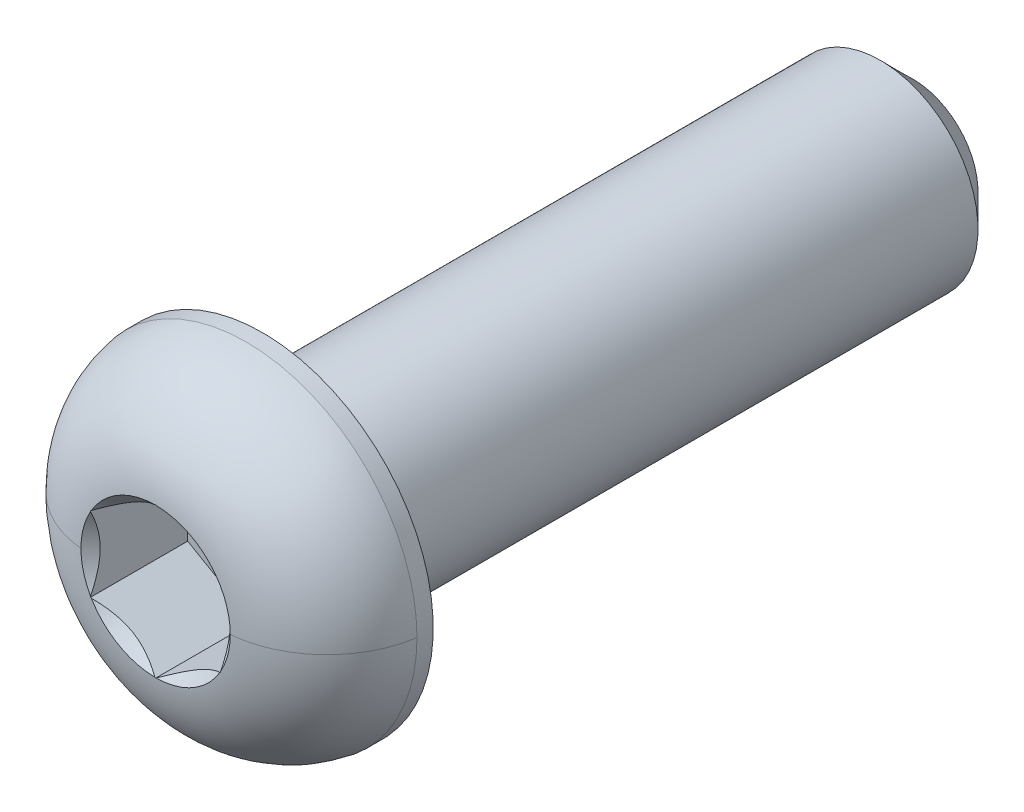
ISO-10303-21;
HEADER;
FILE_DESCRIPTION(('STEP AP214'),'2;1');
FILE_NAME('part.step','',(''),(''),'','','');
FILE_SCHEMA(('AUTOMOTIVE_DESIGN { 1 0 10303 214 1 1 1 1 }'));
ENDSEC;
DATA;
#1=APPLICATION_CONTEXT('core data for automotive mechanical design processes');
#2=APPLICATION_PROTOCOL_DEFINITION('international standard','automotive_design',2000,#1);
#3=PRODUCT_CONTEXT('',#1,'mechanical');
#4=PRODUCT('Part','Part','',(#3));
#5=PRODUCT_RELATED_PRODUCT_CATEGORY('part','',(#4));
#6=PRODUCT_DEFINITION_FORMATION('','',#4);
#7=PRODUCT_DEFINITION_CONTEXT('part definition',#1,'design');
#8=PRODUCT_DEFINITION('design','',#6,#7);
#9=PRODUCT_DEFINITION_SHAPE('','',#8);
#10=(LENGTH_UNIT() NAMED_UNIT(*) SI_UNIT(.MILLI.,.METRE.));
#11=(NAMED_UNIT(*) PLANE_ANGLE_UNIT() SI_UNIT($,.RADIAN.));
#12=(NAMED_UNIT(*) SI_UNIT($,.STERADIAN.) SOLID_ANGLE_UNIT());
#13=UNCERTAINTY_MEASURE_WITH_UNIT(LENGTH_MEASURE(1.E-05),#10,'distance_accuracy_value','');
#14=(GEOMETRIC_REPRESENTATION_CONTEXT(3) GLOBAL_UNCERTAINTY_ASSIGNED_CONTEXT((#13)) GLOBAL_UNIT_ASSIGNED_CONTEXT((#10,
#11,#12)) REPRESENTATION_CONTEXT('',''));
#15=CARTESIAN_POINT('',(0.,0.,0.));
#16=DIRECTION('',(0.,0.,1.));
#17=DIRECTION('',(1.,0.,0.));
#18=AXIS2_PLACEMENT_3D('',#15,#16,#17);
#19=CARTESIAN_POINT('',(-5.313,-5.313,0.));
#20=DIRECTION('',(0.,0.,1.));
#21=DIRECTION('',(1.,0.,0.));
#22=AXIS2_PLACEMENT_3D('',#19,#20,#21);
#23=PLANE('',#22);
#24=CARTESIAN_POINT('',(0.,0.,0.));
#25=DIRECTION('',(0.,0.,-1.));
#26=DIRECTION('',(-1.,0.,0.));
#27=AXIS2_PLACEMENT_3D('',#24,#25,#26);
#28=CIRCLE('',#27,5.25);
#29=CARTESIAN_POINT('',(-5.25,0.,0.));
#30=VERTEX_POINT('',#29);
#31=EDGE_CURVE('E167',#30,#30,#28,.T.);
#32=ORIENTED_EDGE('',*,*,#31,.T.);
#33=EDGE_LOOP('',(#32));
#34=FACE_BOUND('',#33,.T.);
#35=CARTESIAN_POINT('',(0.,0.,-3.011999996E-09));
#36=DIRECTION('',(0.,0.,-1.));
#37=DIRECTION('',(-1.,0.,0.));
#38=AXIS2_PLACEMENT_3D('',#35,#36,#37);
#39=CIRCLE('',#38,3.);
#40=CARTESIAN_POINT('',(-3.,0.,-3.011999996E-09));
#41=VERTEX_POINT('',#40);
#42=EDGE_CURVE('E158',#41,#41,#39,.T.);
#43=ORIENTED_EDGE('',*,*,#42,.F.);
#44=EDGE_LOOP('',(#43));
#45=FACE_BOUND('',#44,.T.);
#46=ADVANCED_FACE('F14',(#34,#45),#23,.F.);
#47=CARTESIAN_POINT('',(0.,0.,2.988822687));
#48=DIRECTION('',(0.,0.,1.));
#49=DIRECTION('',(1.,0.,0.));
#50=AXIS2_PLACEMENT_3D('',#47,#48,#49);
#51=CONICAL_SURFACE('',#50,1.998223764,0.785398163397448);
#52=CARTESIAN_POINT('',(0.,0.,3.28663823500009));
#53=DIRECTION('',(0.,0.,1.));
#54=DIRECTION('',(1.,0.,0.));
#55=AXIS2_PLACEMENT_3D('',#52,#53,#54);
#56=CIRCLE('',#55,2.296039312);
#57=CARTESIAN_POINT('',(-2.,1.12773956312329,3.28663823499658));
#58=VERTEX_POINT('',#57);
#59=CARTESIAN_POINT('',(-2.296039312,-6.27900713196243E-10,3.28663823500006));
#60=VERTEX_POINT('',#59);
#61=EDGE_CURVE('E160',#58,#60,#56,.T.);
#62=ORIENTED_EDGE('',*,*,#61,.T.);
#63=CARTESIAN_POINT('',(0.,0.,3.28663823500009));
#64=DIRECTION('',(0.,0.,1.));
#65=DIRECTION('',(1.,0.,0.));
#66=AXIS2_PLACEMENT_3D('',#63,#64,#65);
#67=CIRCLE('',#66,2.296039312);
#68=CARTESIAN_POINT('',(-2.,-1.12773956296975,3.28663823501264));
#69=VERTEX_POINT('',#68);
#70=EDGE_CURVE('E122',#60,#69,#67,.T.);
#71=ORIENTED_EDGE('',*,*,#70,.T.);
#72=CARTESIAN_POINT('',(-2.00000000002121,-1.12773956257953,3.28663823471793));
#73=CARTESIAN_POINT('',(-2.00000000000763,-1.04995568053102,3.24846468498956));
#74=CARTESIAN_POINT('',(-2.00000000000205,-0.970887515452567,3.21259601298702));
#75=CARTESIAN_POINT('',(-1.99999999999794,-0.809751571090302,3.14703477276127));
#76=CARTESIAN_POINT('',(-1.99999999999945,-0.727669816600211,3.11737685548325));
#77=CARTESIAN_POINT('',(-2.00000000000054,-0.562175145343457,3.0666412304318));
#78=CARTESIAN_POINT('',(-2.00000000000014,-0.478800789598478,3.04544123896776));
#79=CARTESIAN_POINT('',(-1.99999999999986,-0.310294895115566,3.0128477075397));
#80=CARTESIAN_POINT('',(-1.99999999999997,-0.225167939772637,3.00143126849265));
#81=CARTESIAN_POINT('',(-2.00000000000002,-0.0771243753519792,2.99110892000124));
#82=CARTESIAN_POINT('',(-2.00000000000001,-0.0143780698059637,2.98966784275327));
#83=CARTESIAN_POINT('',(-1.99999999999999,0.110995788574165,2.99269670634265));
#84=CARTESIAN_POINT('',(-2.,0.17362329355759,2.99716866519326));
#85=CARTESIAN_POINT('',(-2.,0.298253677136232,3.01176649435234));
#86=CARTESIAN_POINT('',(-2.,0.360256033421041,3.02189674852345));
#87=CARTESIAN_POINT('',(-2.,0.483213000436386,3.04726391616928));
#88=CARTESIAN_POINT('',(-2.,0.544167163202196,3.06250295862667));
#89=CARTESIAN_POINT('',(-2.,0.694818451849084,3.10608759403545));
#90=CARTESIAN_POINT('',(-2.,0.783722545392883,3.13718154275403));
#91=CARTESIAN_POINT('',(-2.,0.914589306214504,3.18943430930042));
#92=CARTESIAN_POINT('',(-2.,0.957734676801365,3.20775597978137));
#93=CARTESIAN_POINT('',(-2.,1.04327976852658,3.24603158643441));
#94=CARTESIAN_POINT('',(-2.,1.08567973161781,3.26598498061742));
#95=CARTESIAN_POINT('',(-2.,1.12773956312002,3.28663823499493));
#96=B_SPLINE_CURVE_WITH_KNOTS('',3,(#72,#73,#74,#75,#76,#77,#78,#79,#80,#81,#82,#83,#84,#85,#86,
#87,#88,#89,#90,#91,#92,#93,#94,#95),.UNSPECIFIED.,.F.,.F.,(4,2,2,2,2,2,2,2,2,2,2,4),(0.,
0.260109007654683,0.521632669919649,0.779224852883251,1.03621246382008,1.22423404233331,
1.41231980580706,1.60055149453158,1.78886172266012,2.07089239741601,2.2114924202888,
2.35204593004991),.UNSPECIFIED.);
#97=EDGE_CURVE('E297',#69,#58,#96,.T.);
#98=ORIENTED_EDGE('',*,*,#97,.T.);
#99=EDGE_LOOP('',(#62,#71,#98));
#100=FACE_BOUND('',#99,.T.);
#101=ADVANCED_FACE('F265',(#100),#51,.F.);
#102=CARTESIAN_POINT('',(2.,-1.154700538,3.304558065));
#103=DIRECTION('',(0.500000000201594,-0.866025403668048,0.));
#104=DIRECTION('',(-0.866025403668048,-0.500000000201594,0.));
#105=AXIS2_PLACEMENT_3D('',#102,#103,#104);
#106=PLANE('',#105);
#107=DIRECTION('',(0.,0.,-1.));
#108=VECTOR('',#107,1.);
#109=CARTESIAN_POINT('',(2.,-1.154700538,1.8022790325));
#110=LINE('',#109,#108);
#111=CARTESIAN_POINT('',(2.00000000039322,-1.15470053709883,3.28540209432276));
#112=VERTEX_POINT('',#111);
#113=CARTESIAN_POINT('',(2.,-1.15470053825,0.3));
#114=VERTEX_POINT('',#113);
#115=EDGE_CURVE('E147',#112,#114,#110,.T.);
#116=ORIENTED_EDGE('',*,*,#115,.T.);
#117=DIRECTION('',(0.866025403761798,0.500000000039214,0.));
#118=VECTOR('',#117,1.);
#119=CARTESIAN_POINT('',(0.,-2.309401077,0.3));
#120=LINE('',#119,#118);
#121=CARTESIAN_POINT('',(0.,-2.309401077,0.3));
#122=VERTEX_POINT('',#121);
#123=EDGE_CURVE('E326',#122,#114,#120,.T.);
#124=ORIENTED_EDGE('',*,*,#123,.F.);
#125=DIRECTION('',(0.,0.,1.));
#126=VECTOR('',#125,1.);
#127=CARTESIAN_POINT('',(0.,-2.309401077,1.802279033));
#128=LINE('',#127,#126);
#129=CARTESIAN_POINT('',(5.87739642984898E-11,-2.30940107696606,3.28540209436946));
#130=VERTEX_POINT('',#129);
#131=EDGE_CURVE('E118',#122,#130,#128,.T.);
#132=ORIENTED_EDGE('',*,*,#131,.T.);
#133=CARTESIAN_POINT('',(0.0233488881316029,-2.2959205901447,3.28663823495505));
#134=CARTESIAN_POINT('',(0.015565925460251,-2.30041408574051,3.28622618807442));
#135=CARTESIAN_POINT('',(0.00778296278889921,-2.30490758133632,3.28581414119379));
#136=CARTESIAN_POINT('',(1.17547386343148E-10,-2.30940107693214,3.28540209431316));
#137=B_SPLINE_CURVE_WITH_KNOTS('',3,(#133,#134,#135,#136),.UNSPECIFIED.,.F.,.F.,(4,4),(0.,
0.0269892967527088),.UNSPECIFIED.);
#138=CARTESIAN_POINT('',(0.0233488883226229,-2.29592059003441,3.28663823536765));
#139=VERTEX_POINT('',#138);
#140=EDGE_CURVE('E111',#139,#130,#137,.T.);
#141=ORIENTED_EDGE('',*,*,#140,.F.);
#142=CARTESIAN_POINT('',(1.97665111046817,-1.16818102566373,3.28663823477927));
#143=CARTESIAN_POINT('',(1.90928829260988,-1.20707296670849,3.24846468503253));
#144=CARTESIAN_POINT('',(1.84081325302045,-1.24660704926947,3.21259601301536));
#145=CARTESIAN_POINT('',(1.7012654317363,-1.32717502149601,3.14703477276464));
#146=CARTESIAN_POINT('',(1.63018054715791,-1.36821589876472,3.11737685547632));
#147=CARTESIAN_POINT('',(1.4868579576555,-1.45096323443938,3.06664123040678));
#148=CARTESIAN_POINT('',(1.41465364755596,-1.49265041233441,3.04544123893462));
#149=CARTESIAN_POINT('',(1.26872326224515,-1.57690335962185,3.01284770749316));
#150=CARTESIAN_POINT('',(1.19500115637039,-1.61946683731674,3.00143126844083));
#151=CARTESIAN_POINT('',(1.06679166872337,-1.69348861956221,2.99110891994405));
#152=CARTESIAN_POINT('',(1.01245177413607,-1.72486177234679,2.98966784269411));
#153=CARTESIAN_POINT('',(0.903874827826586,-1.78754870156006,2.99269670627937));
#154=CARTESIAN_POINT('',(0.84963781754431,-1.8188624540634,2.99716866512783));
#155=CARTESIAN_POINT('',(0.741704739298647,-1.8811776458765,3.01176649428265));
#156=CARTESIAN_POINT('',(0.688009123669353,-1.91217882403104,3.02189674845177));
#157=CARTESIAN_POINT('',(0.581525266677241,-1.97365730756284,3.04726391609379));
#158=CARTESIAN_POINT('',(0.528737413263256,-2.00413438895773,3.06250295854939));
#159=CARTESIAN_POINT('',(0.39826956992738,-2.07946003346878,3.10608759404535));
#160=CARTESIAN_POINT('',(0.321276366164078,-2.12391208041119,3.13718154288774));
#161=CARTESIAN_POINT('',(0.207942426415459,-2.18934546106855,3.18943430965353));
#162=CARTESIAN_POINT('',(0.170577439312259,-2.21091814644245,3.20775598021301));
#163=CARTESIAN_POINT('',(0.0964932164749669,-2.25369069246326,3.24603158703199));
#164=CARTESIAN_POINT('',(0.0597737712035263,-2.27489067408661,3.26598498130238));
#165=CARTESIAN_POINT('',(0.0233488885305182,-2.29592058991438,3.28663823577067));
#166=B_SPLINE_CURVE_WITH_KNOTS('',3,(#142,#143,#144,#145,#146,#147,#148,#149,#150,#151,#152,
#153,#154,#155,#156,#157,#158,#159,#160,#161,#162,#163,#164,#165),.UNSPECIFIED.,.F.,.F.,(4,2,2,
2,2,2,2,2,2,2,2,4),(0.,0.260109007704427,0.521632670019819,0.779224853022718,1.03621246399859,
1.2242340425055,1.41231980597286,1.60055149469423,1.78886172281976,2.07089239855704,
2.21149242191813,2.35204593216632),.UNSPECIFIED.);
#167=CARTESIAN_POINT('',(1.97665111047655,-1.16818102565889,3.28663823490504));
#168=VERTEX_POINT('',#167);
#169=EDGE_CURVE('E115',#168,#139,#166,.T.);
#170=ORIENTED_EDGE('',*,*,#169,.F.);
#171=CARTESIAN_POINT('',(2.00000000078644,-1.15470053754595,3.28540209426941));
#172=CARTESIAN_POINT('',(1.99221703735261,-1.15919403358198,3.28581414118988));
#173=CARTESIAN_POINT('',(1.98443407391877,-1.16368752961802,3.28622618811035));
#174=CARTESIAN_POINT('',(1.97665111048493,-1.16818102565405,3.28663823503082));
#175=B_SPLINE_CURVE_WITH_KNOTS('',3,(#171,#172,#173,#174),.UNSPECIFIED.,.F.,.F.,(4,4),(0.,
0.0269892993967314),.UNSPECIFIED.);
#176=EDGE_CURVE('E121',#112,#168,#175,.T.);
#177=ORIENTED_EDGE('',*,*,#176,.F.);
#178=EDGE_LOOP('',(#116,#124,#132,#141,#170,#177));
#179=FACE_BOUND('',#178,.T.);
#180=ADVANCED_FACE('F113',(#179),#106,.F.);
#181=CARTESIAN_POINT('',(0.,-2.309401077,3.304558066));
#182=DIRECTION('',(-0.500000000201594,-0.866025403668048,0.));
#183=DIRECTION('',(-0.866025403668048,0.500000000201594,0.));
#184=AXIS2_PLACEMENT_3D('',#181,#182,#183);
#185=PLANE('',#184);
#186=ORIENTED_EDGE('',*,*,#131,.F.);
#187=DIRECTION('',(0.866025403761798,-0.500000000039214,0.));
#188=VECTOR('',#187,1.);
#189=CARTESIAN_POINT('',(-2.,-1.1547005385,0.3));
#190=LINE('',#189,#188);
#191=CARTESIAN_POINT('',(-2.,-1.15470053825,0.3));
#192=VERTEX_POINT('',#191);
#193=EDGE_CURVE('E329',#192,#122,#190,.T.);
#194=ORIENTED_EDGE('',*,*,#193,.F.);
#195=DIRECTION('',(0.,0.,1.));
#196=VECTOR('',#195,1.);
#197=CARTESIAN_POINT('',(-2.,-1.154700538,1.802279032));
#198=LINE('',#197,#196);
#199=CARTESIAN_POINT('',(-2.00000000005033,-1.15470053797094,3.28540209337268));
#200=VERTEX_POINT('',#199);
#201=EDGE_CURVE('E142',#192,#200,#198,.T.);
#202=ORIENTED_EDGE('',*,*,#201,.T.);
#203=CARTESIAN_POINT('',(-1.97665111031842,-1.16818102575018,3.28663823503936));
#204=CARTESIAN_POINT('',(-1.98443407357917,-1.16368752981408,3.28622618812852));
#205=CARTESIAN_POINT('',(-1.99221703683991,-1.15919403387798,3.28581414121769));
#206=CARTESIAN_POINT('',(-2.00000000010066,-1.15470053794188,3.28540209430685));
#207=B_SPLINE_CURVE_WITH_KNOTS('',3,(#203,#204,#205,#206),.UNSPECIFIED.,.F.,.F.,(4,4),(0.,
0.0269892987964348),.UNSPECIFIED.);
#208=CARTESIAN_POINT('',(-1.9766511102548,-1.16818102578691,3.28663823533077));
#209=VERTEX_POINT('',#208);
#210=EDGE_CURVE('E153',#209,#200,#207,.T.);
#211=ORIENTED_EDGE('',*,*,#210,.F.);
#212=CARTESIAN_POINT('',(-0.0233488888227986,-2.29592058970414,3.28663823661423));
#213=CARTESIAN_POINT('',(-0.0907117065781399,-2.25702864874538,3.2484646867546));
#214=CARTESIAN_POINT('',(-0.159186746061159,-2.21749456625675,3.21259601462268));
#215=CARTESIAN_POINT('',(-0.29873456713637,-2.13692659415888,3.14703477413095));
#216=CARTESIAN_POINT('',(-0.369819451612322,-2.09588571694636,3.11737685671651));
#217=CARTESIAN_POINT('',(-0.513142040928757,-2.01313838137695,3.06664123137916));
#218=CARTESIAN_POINT('',(-0.585346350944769,-1.97145120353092,3.04544123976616));
#219=CARTESIAN_POINT('',(-0.731276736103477,-1.88719825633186,3.01284770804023));
#220=CARTESIAN_POINT('',(-0.804998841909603,-1.84463477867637,3.00143126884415));
#221=CARTESIAN_POINT('',(-0.93320832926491,-1.77061299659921,2.9911089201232));
#222=CARTESIAN_POINT('',(-0.987548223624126,-1.73923984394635,2.98966784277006));
#223=CARTESIAN_POINT('',(-1.09612516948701,-1.67655291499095,2.99269670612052));
#224=CARTESIAN_POINT('',(-1.15036217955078,-1.64523916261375,2.99716866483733));
#225=CARTESIAN_POINT('',(-1.25829525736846,-1.58292397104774,3.01176649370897));
#226=CARTESIAN_POINT('',(-1.31199087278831,-1.55192279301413,3.02189674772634));
#227=CARTESIAN_POINT('',(-1.4184747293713,-1.49044430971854,3.04726391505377));
#228=CARTESIAN_POINT('',(-1.4712625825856,-1.45996722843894,3.06250295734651));
#229=CARTESIAN_POINT('',(-1.60173042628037,-1.38464158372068,3.10608759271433));
#230=CARTESIAN_POINT('',(-1.67872363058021,-1.34018953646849,3.13718154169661));
#231=CARTESIAN_POINT('',(-1.79205757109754,-1.27475615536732,3.18943430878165));
#232=CARTESIAN_POINT('',(-1.82942255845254,-1.25318346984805,3.20775597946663));
#233=CARTESIAN_POINT('',(-1.90350678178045,-1.21041092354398,3.24603158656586));
#234=CARTESIAN_POINT('',(-1.94022622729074,-1.18921094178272,3.26598498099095));
#235=CARTESIAN_POINT('',(-1.97665111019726,-1.16818102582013,3.28663823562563));
#236=B_SPLINE_CURVE_WITH_KNOTS('',3,(#212,#213,#214,#215,#216,#217,#218,#219,#220,#221,#222,
#223,#224,#225,#226,#227,#228,#229,#230,#231,#232,#233,#234,#235),.UNSPECIFIED.,.F.,.F.,(4,2,2,
2,2,2,2,2,2,2,2,4),(0.,0.260109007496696,0.521632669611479,0.779224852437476,1.03621246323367,
1.22423404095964,1.41231980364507,1.60055149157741,1.78886171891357,2.07089239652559,
2.21149242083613,2.35204593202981),.UNSPECIFIED.);
#237=CARTESIAN_POINT('',(-0.023348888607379,-2.29592058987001,3.28663823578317));
#238=VERTEX_POINT('',#237);
#239=EDGE_CURVE('E127',#238,#209,#236,.T.);
#240=ORIENTED_EDGE('',*,*,#239,.F.);
#241=CARTESIAN_POINT('',(-1.1754803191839E-10,-2.30940107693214,3.28540209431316));
#242=CARTESIAN_POINT('',(-0.00778296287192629,-2.30490758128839,3.28581414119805));
#243=CARTESIAN_POINT('',(-0.0155659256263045,-2.30041408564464,3.28622618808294));
#244=CARTESIAN_POINT('',(-0.0233488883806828,-2.29592059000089,3.28663823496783));
#245=B_SPLINE_CURVE_WITH_KNOTS('',3,(#241,#242,#243,#244),.UNSPECIFIED.,.F.,.F.,(4,4),(0.,
0.0269892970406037),.UNSPECIFIED.);
#246=EDGE_CURVE('E152',#130,#238,#245,.T.);
#247=ORIENTED_EDGE('',*,*,#246,.F.);
#248=EDGE_LOOP('',(#186,#194,#202,#211,#240,#247));
#249=FACE_BOUND('',#248,.T.);
#250=ADVANCED_FACE('F264',(#249),#185,.F.);
#251=CARTESIAN_POINT('',(-2.,-1.154700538,0.3));
#252=DIRECTION('',(-1.,0.,0.));
#253=DIRECTION('',(0.,0.,1.));
#254=AXIS2_PLACEMENT_3D('',#251,#252,#253);
#255=PLANE('',#254);
#256=ORIENTED_EDGE('',*,*,#201,.F.);
#257=DIRECTION('',(0.,-1.,0.));
#258=VECTOR('',#257,1.);
#259=CARTESIAN_POINT('',(-2.,0.,0.3));
#260=LINE('',#259,#258);
#261=CARTESIAN_POINT('',(-2.,1.15470053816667,0.3));
#262=VERTEX_POINT('',#261);
#263=EDGE_CURVE('E331',#262,#192,#260,.T.);
#264=ORIENTED_EDGE('',*,*,#263,.F.);
#265=DIRECTION('',(0.,0.,1.));
#266=VECTOR('',#265,1.);
#267=CARTESIAN_POINT('',(-2.,1.154700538,1.802279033));
#268=LINE('',#267,#266);
#269=CARTESIAN_POINT('',(-2.,1.15470053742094,3.28540209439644));
#270=VERTEX_POINT('',#269);
#271=EDGE_CURVE('E344',#262,#270,#268,.T.);
#272=ORIENTED_EDGE('',*,*,#271,.T.);
#273=CARTESIAN_POINT('',(-2.,1.1277395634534,3.28663823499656));
#274=CARTESIAN_POINT('',(-2.,1.1367265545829,3.28622618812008));
#275=CARTESIAN_POINT('',(-2.,1.14571354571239,3.28581414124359));
#276=CARTESIAN_POINT('',(-2.,1.15470053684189,3.28540209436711));
#277=B_SPLINE_CURVE_WITH_KNOTS('',3,(#273,#274,#275,#276),.UNSPECIFIED.,.F.,.F.,(4,4),(0.,
0.0269892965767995),.UNSPECIFIED.);
#278=EDGE_CURVE('E146',#58,#270,#277,.T.);
#279=ORIENTED_EDGE('',*,*,#278,.F.);
#280=ORIENTED_EDGE('',*,*,#97,.F.);
#281=CARTESIAN_POINT('',(-2.,-1.15470053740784,3.28540209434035));
#282=CARTESIAN_POINT('',(-2.,-1.14571354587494,3.28581414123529));
#283=CARTESIAN_POINT('',(-2.,-1.13672655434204,3.28622618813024));
#284=CARTESIAN_POINT('',(-2.,-1.12773956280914,3.28663823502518));
#285=B_SPLINE_CURVE_WITH_KNOTS('',3,(#281,#282,#283,#284),.UNSPECIFIED.,.F.,.F.,(4,4),(0.,
0.0269892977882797),.UNSPECIFIED.);
#286=EDGE_CURVE('E145',#200,#69,#285,.T.);
#287=ORIENTED_EDGE('',*,*,#286,.F.);
#288=EDGE_LOOP('',(#256,#264,#272,#279,#280,#287));
#289=FACE_BOUND('',#288,.T.);
#290=ADVANCED_FACE('F307',(#289),#255,.F.);
#291=CARTESIAN_POINT('',(2.,1.154700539,3.304558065));
#292=DIRECTION('',(1.,0.,0.));
#293=DIRECTION('',(0.,-1.,0.));
#294=AXIS2_PLACEMENT_3D('',#291,#292,#293);
#295=PLANE('',#294);
#296=DIRECTION('',(0.,0.,-1.));
#297=VECTOR('',#296,1.);
#298=CARTESIAN_POINT('',(2.,1.154700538,1.8022790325));
#299=LINE('',#298,#297);
#300=CARTESIAN_POINT('',(2.00000000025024,1.15470053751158,3.28540209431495));
#301=VERTEX_POINT('',#300);
#302=CARTESIAN_POINT('',(2.,1.154700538,0.3));
#303=VERTEX_POINT('',#302);
#304=EDGE_CURVE('E351',#301,#303,#299,.T.);
#305=ORIENTED_EDGE('',*,*,#304,.T.);
#306=DIRECTION('',(0.,1.,0.));
#307=VECTOR('',#306,1.);
#308=CARTESIAN_POINT('',(2.,0.,0.3));
#309=LINE('',#308,#307);
#310=EDGE_CURVE('E328',#114,#303,#309,.T.);
#311=ORIENTED_EDGE('',*,*,#310,.F.);
#312=ORIENTED_EDGE('',*,*,#115,.F.);
#313=CARTESIAN_POINT('',(2.,-1.12773956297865,3.28663823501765));
#314=CARTESIAN_POINT('',(2.,-1.136726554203,3.28622618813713));
#315=CARTESIAN_POINT('',(2.,-1.14571354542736,3.28581414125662));
#316=CARTESIAN_POINT('',(2.,-1.15470053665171,3.2854020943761));
#317=B_SPLINE_CURVE_WITH_KNOTS('',3,(#313,#314,#315,#316),.UNSPECIFIED.,.F.,.F.,(4,4),(0.,
0.0269892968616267),.UNSPECIFIED.);
#318=CARTESIAN_POINT('',(2.,-1.12773956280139,3.28663823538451));
#319=VERTEX_POINT('',#318);
#320=EDGE_CURVE('E150',#319,#112,#317,.T.);
#321=ORIENTED_EDGE('',*,*,#320,.F.);
#322=CARTESIAN_POINT('',(2.00000000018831,1.12773956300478,3.28663823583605));
#323=CARTESIAN_POINT('',(2.00000000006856,1.05041737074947,3.24869036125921));
#324=CARTESIAN_POINT('',(2.0000000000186,0.97182557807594,3.21302111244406));
#325=CARTESIAN_POINT('',(1.99999999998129,0.81162789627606,3.14775499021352));
#326=CARTESIAN_POINT('',(1.99999999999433,0.730006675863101,3.11819607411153));
#327=CARTESIAN_POINT('',(2.00000000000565,0.564523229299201,3.06726240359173));
#328=CARTESIAN_POINT('',(2.00000000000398,0.4806706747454,3.04585703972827));
#329=CARTESIAN_POINT('',(1.99999999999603,0.311208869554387,3.01297161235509));
#330=CARTESIAN_POINT('',(1.99999999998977,0.225605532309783,3.00146244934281));
#331=CARTESIAN_POINT('',(2.00000000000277,0.116425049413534,2.99384898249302));
#332=CARTESIAN_POINT('',(2.00000000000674,0.0931516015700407,2.99263158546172));
#333=CARTESIAN_POINT('',(1.99999999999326,0.0465865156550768,2.99100636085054));
#334=CARTESIAN_POINT('',(1.99999999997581,0.0232948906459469,2.99059816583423));
#335=CARTESIAN_POINT('',(1.99999999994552,-0.0607004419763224,2.99060089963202));
#336=CARTESIAN_POINT('',(1.99999999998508,-0.121423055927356,2.99337962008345));
#337=CARTESIAN_POINT('',(2.00000000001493,-0.24239446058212,3.00432954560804));
#338=CARTESIAN_POINT('',(2.00000000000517,-0.302642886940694,3.012504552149));
#339=CARTESIAN_POINT('',(1.99999999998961,-0.482559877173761,3.04460765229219));
#340=CARTESIAN_POINT('',(1.99999999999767,-0.600919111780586,3.076108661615));
#341=CARTESIAN_POINT('',(2.00000000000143,-0.787312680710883,3.13893843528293));
#342=CARTESIAN_POINT('',(2.00000000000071,-0.857050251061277,3.16558908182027));
#343=CARTESIAN_POINT('',(1.9999999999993,-0.994046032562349,3.22316548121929));
#344=CARTESIAN_POINT('',(1.9999999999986,-1.06132038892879,3.25405256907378));
#345=CARTESIAN_POINT('',(2.,-1.12773956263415,3.28663823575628));
#346=B_SPLINE_CURVE_WITH_KNOTS('',3,(#322,#323,#324,#325,#326,#327,#328,#329,#330,#331,#332,
#333,#334,#335,#336,#337,#338,#339,#340,#341,#342,#343,#344,#345),.UNSPECIFIED.,.F.,.F.,(4,2,2,
2,2,2,2,2,2,2,2,4),(0.,0.258566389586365,0.518693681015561,0.77783456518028,1.0362108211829,
1.1061169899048,1.17599140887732,1.35806602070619,1.54026903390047,1.90609911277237,
2.12994702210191,2.3518732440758),.UNSPECIFIED.);
#347=CARTESIAN_POINT('',(2.,1.12773956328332,3.28663823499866));
#348=VERTEX_POINT('',#347);
#349=EDGE_CURVE('E128',#348,#319,#346,.T.);
#350=ORIENTED_EDGE('',*,*,#349,.F.);
#351=CARTESIAN_POINT('',(2.,1.15470053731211,3.28540209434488));
#352=CARTESIAN_POINT('',(2.,1.14571354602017,3.28581414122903));
#353=CARTESIAN_POINT('',(2.,1.13672655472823,3.28622618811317));
#354=CARTESIAN_POINT('',(2.,1.12773956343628,3.28663823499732));
#355=B_SPLINE_CURVE_WITH_KNOTS('',3,(#351,#352,#353,#354),.UNSPECIFIED.,.F.,.F.,(4,4),(0.,
0.0269892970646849),.UNSPECIFIED.);
#356=EDGE_CURVE('E149',#301,#348,#355,.T.);
#357=ORIENTED_EDGE('',*,*,#356,.F.);
#358=EDGE_LOOP('',(#305,#311,#312,#321,#350,#357));
#359=FACE_BOUND('',#358,.T.);
#360=ADVANCED_FACE('F310',(#359),#295,.F.);
#361=CARTESIAN_POINT('',(-2.,-2.309401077,0.3));
#362=DIRECTION('',(0.,0.,1.));
#363=DIRECTION('',(1.,0.,0.));
#364=AXIS2_PLACEMENT_3D('',#361,#362,#363);
#365=PLANE('',#364);
#366=ORIENTED_EDGE('',*,*,#263,.T.);
#367=ORIENTED_EDGE('',*,*,#193,.T.);
#368=ORIENTED_EDGE('',*,*,#123,.T.);
#369=ORIENTED_EDGE('',*,*,#310,.T.);
#370=DIRECTION('',(-0.866025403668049,0.500000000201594,0.));
#371=VECTOR('',#370,1.);
#372=CARTESIAN_POINT('',(1.,1.7320508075,0.3));
#373=LINE('',#372,#371);
#374=CARTESIAN_POINT('',(0.,2.309401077,0.3));
#375=VERTEX_POINT('',#374);
#376=EDGE_CURVE('E353',#303,#375,#373,.T.);
#377=ORIENTED_EDGE('',*,*,#376,.T.);
#378=DIRECTION('',(-0.866025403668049,-0.500000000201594,0.));
#379=VECTOR('',#378,1.);
#380=CARTESIAN_POINT('',(-1.,1.7320508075,0.3));
#381=LINE('',#380,#379);
#382=EDGE_CURVE('E348',#375,#262,#381,.T.);
#383=ORIENTED_EDGE('',*,*,#382,.T.);
#384=EDGE_LOOP('',(#366,#367,#368,#369,#377,#383));
#385=FACE_BOUND('',#384,.T.);
#386=ADVANCED_FACE('F292',(#385),#365,.T.);
#387=CARTESIAN_POINT('',(0.,0.,2.98868375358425));
#388=DIRECTION('',(0.,0.,1.));
#389=DIRECTION('',(0.,-1.,0.));
#390=AXIS2_PLACEMENT_3D('',#387,#388,#389);
#391=CONICAL_SURFACE('',#390,1.99808483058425,0.785398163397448);
#392=ORIENTED_EDGE('',*,*,#169,.T.);
#393=CARTESIAN_POINT('',(0.,0.,3.286638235));
#394=DIRECTION('',(0.,0.,-1.));
#395=DIRECTION('',(-1.,0.,0.));
#396=AXIS2_PLACEMENT_3D('',#393,#394,#395);
#397=CIRCLE('',#396,2.296039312);
#398=EDGE_CURVE('E126',#168,#139,#397,.T.);
#399=ORIENTED_EDGE('',*,*,#398,.F.);
#400=EDGE_LOOP('',(#392,#399));
#401=FACE_BOUND('',#400,.T.);
#402=ADVANCED_FACE('F125',(#401),#391,.F.);
#403=CARTESIAN_POINT('',(0.,0.,2.98868375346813));
#404=DIRECTION('',(0.,0.,1.));
#405=DIRECTION('',(0.,-1.,0.));
#406=AXIS2_PLACEMENT_3D('',#403,#404,#405);
#407=CONICAL_SURFACE('',#406,1.99808483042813,0.785398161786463);
#408=ORIENTED_EDGE('',*,*,#239,.T.);
#409=CARTESIAN_POINT('',(0.,0.,3.286638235));
#410=DIRECTION('',(0.,0.,-1.));
#411=DIRECTION('',(-1.,0.,0.));
#412=AXIS2_PLACEMENT_3D('',#409,#410,#411);
#413=CIRCLE('',#412,2.296039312);
#414=EDGE_CURVE('E132',#238,#209,#413,.T.);
#415=ORIENTED_EDGE('',*,*,#414,.F.);
#416=EDGE_LOOP('',(#408,#415));
#417=FACE_BOUND('',#416,.T.);
#418=ADVANCED_FACE('F291',(#417),#407,.F.);
#419=CARTESIAN_POINT('',(-2.,1.154700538,3.304558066));
#420=DIRECTION('',(-0.500000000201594,0.866025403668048,0.));
#421=DIRECTION('',(0.866025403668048,0.500000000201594,0.));
#422=AXIS2_PLACEMENT_3D('',#419,#420,#421);
#423=PLANE('',#422);
#424=ORIENTED_EDGE('',*,*,#271,.F.);
#425=ORIENTED_EDGE('',*,*,#382,.F.);
#426=DIRECTION('',(0.,0.,1.));
#427=VECTOR('',#426,1.);
#428=CARTESIAN_POINT('',(0.,2.309401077,1.8022790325));
#429=LINE('',#428,#427);
#430=CARTESIAN_POINT('',(-5.47140685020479E-11,2.30940107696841,3.28540209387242));
#431=VERTEX_POINT('',#430);
#432=EDGE_CURVE('E360',#375,#431,#429,.T.);
#433=ORIENTED_EDGE('',*,*,#432,.T.);
#434=CARTESIAN_POINT('',(-0.0233488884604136,2.29592058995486,3.28663823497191));
#435=CARTESIAN_POINT('',(-0.0155659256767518,2.30041408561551,3.28622618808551));
#436=CARTESIAN_POINT('',(-0.00778296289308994,2.30490758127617,3.28581414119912));
#437=CARTESIAN_POINT('',(-1.09428082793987E-10,2.30940107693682,3.28540209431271));
#438=B_SPLINE_CURVE_WITH_KNOTS('',3,(#434,#435,#436,#437),.UNSPECIFIED.,.F.,.F.,(4,4),(0.,
0.0269892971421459),.UNSPECIFIED.);
#439=CARTESIAN_POINT('',(-0.0233488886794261,2.29592058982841,3.28663823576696));
#440=VERTEX_POINT('',#439);
#441=EDGE_CURVE('E364',#440,#431,#438,.T.);
#442=ORIENTED_EDGE('',*,*,#441,.F.);
#443=CARTESIAN_POINT('',(-1.97665111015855,1.16818102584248,3.28663823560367));
#444=CARTESIAN_POINT('',(-1.90928829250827,1.20707296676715,3.24846468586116));
#445=CARTESIAN_POINT('',(-1.84081325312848,1.2466070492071,3.21259601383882));
#446=CARTESIAN_POINT('',(-1.70126543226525,1.32717502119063,3.14703477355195));
#447=CARTESIAN_POINT('',(-1.63018054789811,1.36821589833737,3.11737685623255));
#448=CARTESIAN_POINT('',(-1.4868579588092,1.45096323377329,3.06664123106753));
#449=CARTESIAN_POINT('',(-1.41465364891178,1.49265041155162,3.04544123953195));
#450=CARTESIAN_POINT('',(-1.26872326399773,1.57690335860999,3.01284770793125));
#451=CARTESIAN_POINT('',(-1.19500115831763,1.61946683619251,3.00143126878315));
#452=CARTESIAN_POINT('',(-1.06679167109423,1.69348861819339,2.99110892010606));
#453=CARTESIAN_POINT('',(-1.01245177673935,1.72486177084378,2.98966784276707));
#454=CARTESIAN_POINT('',(-0.903874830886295,1.78754869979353,2.99269670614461));
#455=CARTESIAN_POINT('',(-0.849637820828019,1.81886245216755,2.99716866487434));
#456=CARTESIAN_POINT('',(-0.741704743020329,1.88117764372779,3.01176649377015));
#457=CARTESIAN_POINT('',(-0.688009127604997,1.9121788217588,3.02189674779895));
#458=CARTESIAN_POINT('',(-0.581525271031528,1.97365730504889,3.0472639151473));
#459=CARTESIAN_POINT('',(-0.528737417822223,2.00413438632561,3.06250295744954));
#460=CARTESIAN_POINT('',(-0.398269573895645,2.0794600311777,3.10608759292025));
#461=CARTESIAN_POINT('',(-0.321276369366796,2.1239120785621,3.1371815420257));
#462=CARTESIAN_POINT('',(-0.207942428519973,2.18934545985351,3.18943430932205));
#463=CARTESIAN_POINT('',(-0.170577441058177,2.21091814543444,3.20775598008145));
#464=CARTESIAN_POINT('',(-0.0964932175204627,2.25369069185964,3.24603158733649));
#465=CARTESIAN_POINT('',(-0.059773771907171,2.27489067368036,3.26598498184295));
#466=CARTESIAN_POINT('',(-0.0233488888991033,2.29592058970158,3.28663823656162));
#467=B_SPLINE_CURVE_WITH_KNOTS('',3,(#443,#444,#445,#446,#447,#448,#449,#450,#451,#452,#453,
#454,#455,#456,#457,#458,#459,#460,#461,#462,#463,#464,#465,#466),.UNSPECIFIED.,.F.,.F.,(4,2,2,
2,2,2,2,2,2,2,2,4),(0.,0.260109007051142,0.521632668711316,0.779224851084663,1.03621246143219,
1.22423403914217,1.41231980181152,1.60055148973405,1.78886171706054,2.07089239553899,
2.21149242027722,2.35204593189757),.UNSPECIFIED.);
#468=CARTESIAN_POINT('',(-1.9766511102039,1.1681810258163,3.28663823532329));
#469=VERTEX_POINT('',#468);
#470=EDGE_CURVE('E136',#469,#440,#467,.T.);
#471=ORIENTED_EDGE('',*,*,#470,.F.);
#472=CARTESIAN_POINT('',(-2.00000000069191,1.15470053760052,3.28540209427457));
#473=CARTESIAN_POINT('',(-1.99221703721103,1.15919403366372,3.28581414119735));
#474=CARTESIAN_POINT('',(-1.98443407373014,1.16368752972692,3.28622618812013));
#475=CARTESIAN_POINT('',(-1.97665111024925,1.16818102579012,3.28663823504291));
#476=B_SPLINE_CURVE_WITH_KNOTS('',3,(#472,#473,#474,#475),.UNSPECIFIED.,.F.,.F.,(4,4),(0.,
0.0269892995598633),.UNSPECIFIED.);
#477=EDGE_CURVE('E347',#270,#469,#476,.T.);
#478=ORIENTED_EDGE('',*,*,#477,.F.);
#479=EDGE_LOOP('',(#424,#425,#433,#442,#471,#478));
#480=FACE_BOUND('',#479,.T.);
#481=ADVANCED_FACE('F426',(#480),#423,.F.);
#482=CARTESIAN_POINT('',(0.,2.309401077,3.304558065));
#483=DIRECTION('',(0.500000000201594,0.866025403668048,0.));
#484=DIRECTION('',(0.866025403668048,-0.500000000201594,0.));
#485=AXIS2_PLACEMENT_3D('',#482,#483,#484);
#486=PLANE('',#485);
#487=ORIENTED_EDGE('',*,*,#432,.F.);
#488=ORIENTED_EDGE('',*,*,#376,.F.);
#489=ORIENTED_EDGE('',*,*,#304,.F.);
#490=CARTESIAN_POINT('',(1.97665111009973,1.16818102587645,3.28663823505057));
#491=CARTESIAN_POINT('',(1.98443407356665,1.16368752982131,3.28622618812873));
#492=CARTESIAN_POINT('',(1.99221703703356,1.15919403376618,3.28581414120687));
#493=CARTESIAN_POINT('',(2.00000000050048,1.15470053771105,3.28540209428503));
#494=B_SPLINE_CURVE_WITH_KNOTS('',3,(#490,#491,#492,#493),.UNSPECIFIED.,.F.,.F.,(4,4),(0.,
0.0269892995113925),.UNSPECIFIED.);
#495=CARTESIAN_POINT('',(1.9766511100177,1.16818102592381,3.28663823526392));
#496=VERTEX_POINT('',#495);
#497=EDGE_CURVE('E354',#496,#301,#494,.T.);
#498=ORIENTED_EDGE('',*,*,#497,.F.);
#499=CARTESIAN_POINT('',(0.0233488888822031,2.29592058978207,3.28663823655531));
#500=CARTESIAN_POINT('',(0.0907117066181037,2.25702864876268,3.24846468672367));
#501=CARTESIAN_POINT('',(0.1591867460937,2.21749456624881,3.21259601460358));
#502=CARTESIAN_POINT('',(0.29873456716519,2.13692659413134,3.14703477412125));
#503=CARTESIAN_POINT('',(0.369819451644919,2.09588571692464,3.11737685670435));
#504=CARTESIAN_POINT('',(0.513142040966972,2.01313838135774,3.06664123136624));
#505=CARTESIAN_POINT('',(0.585346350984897,1.97145120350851,3.045441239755));
#506=CARTESIAN_POINT('',(0.731276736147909,1.88719825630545,3.0128477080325));
#507=CARTESIAN_POINT('',(0.804998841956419,1.84463477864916,3.00143126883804));
#508=CARTESIAN_POINT('',(0.933208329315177,1.77061299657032,2.99110892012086));
#509=CARTESIAN_POINT('',(0.987548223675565,1.73923984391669,2.98966784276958));
#510=CARTESIAN_POINT('',(1.09612516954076,1.67655291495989,2.99269670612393));
#511=CARTESIAN_POINT('',(1.15036217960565,1.64523916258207,2.99716866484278));
#512=CARTESIAN_POINT('',(1.25829525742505,1.58292397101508,3.01176649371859));
#513=CARTESIAN_POINT('',(1.3119908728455,1.55192279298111,3.02189674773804));
#514=CARTESIAN_POINT('',(1.41847472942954,1.49044430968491,3.04726391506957));
#515=CARTESIAN_POINT('',(1.47126258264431,1.45996722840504,3.06250295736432));
#516=CARTESIAN_POINT('',(1.60173042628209,1.38464158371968,3.10608759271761));
#517=CARTESIAN_POINT('',(1.67872363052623,1.34018953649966,3.1371815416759));
#518=CARTESIAN_POINT('',(1.79205757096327,1.27475615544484,3.18943430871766));
#519=CARTESIAN_POINT('',(1.82942255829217,1.25318346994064,3.20775597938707));
#520=CARTESIAN_POINT('',(1.90350678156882,1.21041092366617,3.24603158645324));
#521=CARTESIAN_POINT('',(1.94022622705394,1.18921094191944,3.26598498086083));
#522=CARTESIAN_POINT('',(1.97665110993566,1.16818102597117,3.28663823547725));
#523=B_SPLINE_CURVE_WITH_KNOTS('',3,(#499,#500,#501,#502,#503,#504,#505,#506,#507,#508,#509,
#510,#511,#512,#513,#514,#515,#516,#517,#518,#519,#520,#521,#522),.UNSPECIFIED.,.F.,.F.,(4,2,2,
2,2,2,2,2,2,2,2,4),(0.,0.260109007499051,0.521632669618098,0.779224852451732,1.03621246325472,
1.2242340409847,1.41231980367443,1.60055149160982,1.78886171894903,2.07089239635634,
2.21149242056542,2.35204593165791),.UNSPECIFIED.);
#524=CARTESIAN_POINT('',(0.0233488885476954,2.29592058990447,3.28663823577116));
#525=VERTEX_POINT('',#524);
#526=EDGE_CURVE('E174',#525,#496,#523,.T.);
#527=ORIENTED_EDGE('',*,*,#526,.F.);
#528=CARTESIAN_POINT('',(1.09427069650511E-10,2.30940107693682,3.28540209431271));
#529=CARTESIAN_POINT('',(0.0077829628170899,2.30490758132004,3.28581414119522));
#530=CARTESIAN_POINT('',(0.0155659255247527,2.30041408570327,3.28622618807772));
#531=CARTESIAN_POINT('',(0.0233488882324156,2.29592059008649,3.28663823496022));
#532=B_SPLINE_CURVE_WITH_KNOTS('',3,(#528,#529,#530,#531),.UNSPECIFIED.,.F.,.F.,(4,4),(0.,
0.0269892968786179),.UNSPECIFIED.);
#533=EDGE_CURVE('E369',#431,#525,#532,.T.);
#534=ORIENTED_EDGE('',*,*,#533,.F.);
#535=EDGE_LOOP('',(#487,#488,#489,#498,#527,#534));
#536=FACE_BOUND('',#535,.T.);
#537=ADVANCED_FACE('F190',(#536),#486,.F.);
#538=CARTESIAN_POINT('',(0.,0.,-1.E-09));
#539=DIRECTION('',(0.,0.,-1.));
#540=DIRECTION('',(-1.,0.,0.));
#541=AXIS2_PLACEMENT_3D('',#538,#539,#540);
#542=CYLINDRICAL_SURFACE('',#541,3.);
#543=CARTESIAN_POINT('',(0.,0.,-19.));
#544=DIRECTION('',(0.,0.,-1.));
#545=DIRECTION('',(-1.,0.,0.));
#546=AXIS2_PLACEMENT_3D('',#543,#544,#545);
#547=CIRCLE('',#546,3.);
#548=CARTESIAN_POINT('',(-3.,0.,-19.));
#549=VERTEX_POINT('',#548);
#550=EDGE_CURVE('E9',#549,#549,#547,.F.);
#551=ORIENTED_EDGE('',*,*,#550,.T.);
#552=EDGE_LOOP('',(#551));
#553=FACE_BOUND('',#552,.T.);
#554=ORIENTED_EDGE('',*,*,#42,.T.);
#555=EDGE_LOOP('',(#554));
#556=FACE_BOUND('',#555,.T.);
#557=ADVANCED_FACE('F438',(#553,#556),#542,.T.);
#558=CARTESIAN_POINT('',(0.,0.,2.988822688));
#559=DIRECTION('',(0.,0.,1.));
#560=DIRECTION('',(0.,-1.,0.));
#561=AXIS2_PLACEMENT_3D('',#558,#559,#560);
#562=CONICAL_SURFACE('',#561,1.998223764,0.785398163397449);
#563=CARTESIAN_POINT('',(0.,0.,3.286638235));
#564=DIRECTION('',(0.,0.,-1.));
#565=DIRECTION('',(-1.,0.,0.));
#566=AXIS2_PLACEMENT_3D('',#563,#564,#565);
#567=CIRCLE('',#566,2.296039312);
#568=CARTESIAN_POINT('',(2.29603931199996,-2.06169700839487E-10,3.28663823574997));
#569=VERTEX_POINT('',#568);
#570=EDGE_CURVE('E154',#348,#569,#567,.T.);
#571=ORIENTED_EDGE('',*,*,#570,.F.);
#572=ORIENTED_EDGE('',*,*,#349,.T.);
#573=CARTESIAN_POINT('',(0.,0.,3.286638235));
#574=DIRECTION('',(0.,0.,-1.));
#575=DIRECTION('',(-1.,0.,0.));
#576=AXIS2_PLACEMENT_3D('',#573,#574,#575);
#577=CIRCLE('',#576,2.296039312);
#578=EDGE_CURVE('E133',#569,#319,#577,.T.);
#579=ORIENTED_EDGE('',*,*,#578,.F.);
#580=EDGE_LOOP('',(#571,#572,#579));
#581=FACE_BOUND('',#580,.T.);
#582=ADVANCED_FACE('F212',(#581),#562,.F.);
#583=CARTESIAN_POINT('',(5.25,0.,0.5));
#584=CARTESIAN_POINT('',(5.25000000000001,-10.5,0.5));
#585=CARTESIAN_POINT('',(-5.25000000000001,-10.5,0.5));
#586=CARTESIAN_POINT('',(-5.25,0.,0.5));
#587=CARTESIAN_POINT('',(5.016462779,0.,2.061203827));
#588=CARTESIAN_POINT('',(5.016462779,-10.032925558,2.061203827));
#589=CARTESIAN_POINT('',(-5.016462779,-10.032925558,2.061203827));
#590=CARTESIAN_POINT('',(-5.016462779,0.,2.061203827));
#591=CARTESIAN_POINT('',(3.86819508,0.,3.14442971));
#592=CARTESIAN_POINT('',(3.86819508,-7.73639016,3.14442971));
#593=CARTESIAN_POINT('',(-3.86819508,-7.73639016,3.14442971));
#594=CARTESIAN_POINT('',(-3.86819508,0.,3.14442971));
#595=CARTESIAN_POINT('',(2.296039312,0.,3.286638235));
#596=CARTESIAN_POINT('',(2.296039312,-4.592078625,3.286638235));
#597=CARTESIAN_POINT('',(-2.296039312,-4.592078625,3.286638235));
#598=CARTESIAN_POINT('',(-2.296039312,0.,3.286638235));
#599=(BOUNDED_SURFACE() B_SPLINE_SURFACE(3,3,((#583,#584,#585,#586),(#587,#588,#589,#590),(#591,
#592,#593,#594),(#595,#596,#597,#598)),.UNSPECIFIED.,.F.,.F.,
.F.) B_SPLINE_SURFACE_WITH_KNOTS((4,4),(4,4),(0.,1.),(0.,1.),
.UNSPECIFIED.) GEOMETRIC_REPRESENTATION_ITEM() RATIONAL_B_SPLINE_SURFACE(((1.,0.333333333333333,
0.333333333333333,1.),(0.857512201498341,0.285837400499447,0.285837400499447,0.857512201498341),
(0.857512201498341,0.285837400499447,0.285837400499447,0.857512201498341),(1.,0.333333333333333,
0.333333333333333,1.))) REPRESENTATION_ITEM('') SURFACE());
#600=CARTESIAN_POINT('',(-5.25,0.,0.5));
#601=CARTESIAN_POINT('',(-5.016462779,0.,2.061203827));
#602=CARTESIAN_POINT('',(-3.86819508,0.,3.14442971));
#603=CARTESIAN_POINT('',(-2.296039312,0.,3.286638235));
#604=(BOUNDED_CURVE() B_SPLINE_CURVE(3,(#600,#601,#602,#603),.UNSPECIFIED.,.F.,
.F.) B_SPLINE_CURVE_WITH_KNOTS((4,4),(0.,1.),
.UNSPECIFIED.) CURVE() GEOMETRIC_REPRESENTATION_ITEM() RATIONAL_B_SPLINE_CURVE((1.,
0.85751220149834,0.85751220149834,1.)) REPRESENTATION_ITEM(''));
#605=CARTESIAN_POINT('',(-5.25,-6.28555399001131E-10,0.5));
#606=VERTEX_POINT('',#605);
#607=EDGE_CURVE('E374',#606,#60,#604,.T.);
#608=CARTESIAN_POINT('',(0.,0.,0.5));
#609=DIRECTION('',(0.,0.,1.));
#610=DIRECTION('',(1.,0.,0.));
#611=AXIS2_PLACEMENT_3D('',#608,#609,#610);
#612=CIRCLE('',#611,5.25);
#613=CARTESIAN_POINT('',(5.25,-2.15358599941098E-09,0.5));
#614=VERTEX_POINT('',#613);
#615=EDGE_CURVE('E31',#606,#614,#612,.T.);
#616=CARTESIAN_POINT('',(5.25,0.,0.5));
#617=CARTESIAN_POINT('',(5.016462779,0.,2.061203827));
#618=CARTESIAN_POINT('',(3.86819508,0.,3.14442971));
#619=CARTESIAN_POINT('',(2.296039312,0.,3.286638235));
#620=(BOUNDED_CURVE() B_SPLINE_CURVE(3,(#616,#617,#618,#619),.UNSPECIFIED.,.F.,
.F.) B_SPLINE_CURVE_WITH_KNOTS((4,4),(0.,1.),
.UNSPECIFIED.) CURVE() GEOMETRIC_REPRESENTATION_ITEM() RATIONAL_B_SPLINE_CURVE((1.,
0.85751220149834,0.85751220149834,1.)) REPRESENTATION_ITEM(''));
#621=EDGE_CURVE('E157',#569,#614,#620,.F.);
#622=ORIENTED_EDGE('',*,*,#286,.T.);
#623=ORIENTED_EDGE('',*,*,#70,.F.);
#624=ORIENTED_EDGE('',*,*,#607,.F.);
#625=ORIENTED_EDGE('',*,*,#615,.T.);
#626=ORIENTED_EDGE('',*,*,#621,.F.);
#627=ORIENTED_EDGE('',*,*,#578,.T.);
#628=ORIENTED_EDGE('',*,*,#320,.T.);
#629=ORIENTED_EDGE('',*,*,#176,.T.);
#630=ORIENTED_EDGE('',*,*,#398,.T.);
#631=ORIENTED_EDGE('',*,*,#140,.T.);
#632=ORIENTED_EDGE('',*,*,#246,.T.);
#633=ORIENTED_EDGE('',*,*,#414,.T.);
#634=ORIENTED_EDGE('',*,*,#210,.T.);
#635=EDGE_LOOP('',(#622,#623,#624,#625,#626,#627,#628,#629,#630,#631,#632,#633,#634));
#636=FACE_BOUND('',#635,.T.);
#637=ADVANCED_FACE('F131',(#636),#599,.T.);
#638=CARTESIAN_POINT('',(0.,0.,2.98868375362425));
#639=DIRECTION('',(0.,0.,1.));
#640=DIRECTION('',(0.,-1.,0.));
#641=AXIS2_PLACEMENT_3D('',#638,#639,#640);
#642=CONICAL_SURFACE('',#641,1.99808483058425,0.785398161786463);
#643=ORIENTED_EDGE('',*,*,#470,.T.);
#644=CARTESIAN_POINT('',(0.,0.,3.286638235));
#645=DIRECTION('',(0.,0.,-1.));
#646=DIRECTION('',(-1.,0.,0.));
#647=AXIS2_PLACEMENT_3D('',#644,#645,#646);
#648=CIRCLE('',#647,2.296039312);
#649=EDGE_CURVE('E380',#469,#440,#648,.T.);
#650=ORIENTED_EDGE('',*,*,#649,.F.);
#651=EDGE_LOOP('',(#643,#650));
#652=FACE_BOUND('',#651,.T.);
#653=ADVANCED_FACE('F197',(#652),#642,.F.);
#654=CARTESIAN_POINT('',(0.,0.,2.98868375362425));
#655=DIRECTION('',(0.,0.,1.));
#656=DIRECTION('',(0.,-1.,0.));
#657=AXIS2_PLACEMENT_3D('',#654,#655,#656);
#658=CONICAL_SURFACE('',#657,1.99808483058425,0.785398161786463);
#659=ORIENTED_EDGE('',*,*,#526,.T.);
#660=CARTESIAN_POINT('',(0.,0.,3.286638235));
#661=DIRECTION('',(0.,0.,-1.));
#662=DIRECTION('',(-1.,0.,0.));
#663=AXIS2_PLACEMENT_3D('',#660,#661,#662);
#664=CIRCLE('',#663,2.296039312);
#665=EDGE_CURVE('E171',#525,#496,#664,.T.);
#666=ORIENTED_EDGE('',*,*,#665,.F.);
#667=EDGE_LOOP('',(#659,#666));
#668=FACE_BOUND('',#667,.T.);
#669=ADVANCED_FACE('F192',(#668),#658,.F.);
#670=CARTESIAN_POINT('',(-5.25,0.,0.5));
#671=CARTESIAN_POINT('',(-5.25000000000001,10.5,0.5));
#672=CARTESIAN_POINT('',(5.25000000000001,10.5,0.5));
#673=CARTESIAN_POINT('',(5.25,0.,0.5));
#674=CARTESIAN_POINT('',(-5.016462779,0.,2.061203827));
#675=CARTESIAN_POINT('',(-5.016462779,10.032925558,2.061203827));
#676=CARTESIAN_POINT('',(5.016462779,10.032925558,2.061203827));
#677=CARTESIAN_POINT('',(5.016462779,0.,2.061203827));
#678=CARTESIAN_POINT('',(-3.86819508,0.,3.14442971));
#679=CARTESIAN_POINT('',(-3.86819508,7.73639016,3.14442971));
#680=CARTESIAN_POINT('',(3.86819508,7.73639016,3.14442971));
#681=CARTESIAN_POINT('',(3.86819508,0.,3.14442971));
#682=CARTESIAN_POINT('',(-2.296039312,0.,3.286638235));
#683=CARTESIAN_POINT('',(-2.296039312,4.592078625,3.286638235));
#684=CARTESIAN_POINT('',(2.296039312,4.592078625,3.286638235));
#685=CARTESIAN_POINT('',(2.296039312,0.,3.286638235));
#686=(BOUNDED_SURFACE() B_SPLINE_SURFACE(3,3,((#670,#671,#672,#673),(#674,#675,#676,#677),(#678,
#679,#680,#681),(#682,#683,#684,#685)),.UNSPECIFIED.,.F.,.F.,
.F.) B_SPLINE_SURFACE_WITH_KNOTS((4,4),(4,4),(0.,1.),(0.,1.),
.UNSPECIFIED.) GEOMETRIC_REPRESENTATION_ITEM() RATIONAL_B_SPLINE_SURFACE(((1.,0.333333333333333,
0.333333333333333,1.),(0.85751220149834,0.285837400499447,0.285837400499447,0.85751220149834),
(0.85751220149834,0.285837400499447,0.285837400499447,0.85751220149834),(1.,0.333333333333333,
0.333333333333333,1.))) REPRESENTATION_ITEM('') SURFACE());
#687=CARTESIAN_POINT('',(0.,0.,0.5));
#688=DIRECTION('',(0.,0.,-1.));
#689=DIRECTION('',(-1.,0.,0.));
#690=AXIS2_PLACEMENT_3D('',#687,#688,#689);
#691=CIRCLE('',#690,5.25);
#692=EDGE_CURVE('E170',#614,#606,#691,.F.);
#693=ORIENTED_EDGE('',*,*,#533,.T.);
#694=ORIENTED_EDGE('',*,*,#665,.T.);
#695=ORIENTED_EDGE('',*,*,#497,.T.);
#696=ORIENTED_EDGE('',*,*,#356,.T.);
#697=ORIENTED_EDGE('',*,*,#570,.T.);
#698=ORIENTED_EDGE('',*,*,#621,.T.);
#699=ORIENTED_EDGE('',*,*,#692,.T.);
#700=ORIENTED_EDGE('',*,*,#607,.T.);
#701=ORIENTED_EDGE('',*,*,#61,.F.);
#702=ORIENTED_EDGE('',*,*,#278,.T.);
#703=ORIENTED_EDGE('',*,*,#477,.T.);
#704=ORIENTED_EDGE('',*,*,#649,.T.);
#705=ORIENTED_EDGE('',*,*,#441,.T.);
#706=EDGE_LOOP('',(#693,#694,#695,#696,#697,#698,#699,#700,#701,#702,#703,#704,#705));
#707=FACE_BOUND('',#706,.T.);
#708=ADVANCED_FACE('F196',(#707),#686,.T.);
#709=CARTESIAN_POINT('',(0.,0.,0.5));
#710=DIRECTION('',(0.,0.,-1.));
#711=DIRECTION('',(-1.,0.,0.));
#712=AXIS2_PLACEMENT_3D('',#709,#710,#711);
#713=CYLINDRICAL_SURFACE('',#712,5.25);
#714=ORIENTED_EDGE('',*,*,#615,.F.);
#715=ORIENTED_EDGE('',*,*,#692,.F.);
#716=EDGE_LOOP('',(#714,#715));
#717=FACE_BOUND('',#716,.T.);
#718=ORIENTED_EDGE('',*,*,#31,.F.);
#719=EDGE_LOOP('',(#718));
#720=FACE_BOUND('',#719,.T.);
#721=ADVANCED_FACE('F443',(#717,#720),#713,.T.);
#722=CARTESIAN_POINT('',(2.121638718,-2.121638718,-20.));
#723=DIRECTION('',(0.,0.,-1.));
#724=DIRECTION('',(-1.,0.,0.));
#725=AXIS2_PLACEMENT_3D('',#722,#723,#724);
#726=PLANE('',#725);
#727=CARTESIAN_POINT('',(0.,0.,-20.));
#728=DIRECTION('',(0.,0.,-1.));
#729=DIRECTION('',(-1.,0.,0.));
#730=AXIS2_PLACEMENT_3D('',#727,#728,#729);
#731=CIRCLE('',#730,2.);
#732=CARTESIAN_POINT('',(-2.,0.,-20.));
#733=VERTEX_POINT('',#732);
#734=EDGE_CURVE('E23',#733,#733,#731,.T.);
#735=ORIENTED_EDGE('',*,*,#734,.T.);
#736=EDGE_LOOP('',(#735));
#737=FACE_BOUND('',#736,.T.);
#738=ADVANCED_FACE('F266',(#737),#726,.T.);
#739=CARTESIAN_POINT('',(0.,0.,-20.));
#740=DIRECTION('',(0.,0.,1.));
#741=DIRECTION('',(1.,0.,0.));
#742=AXIS2_PLACEMENT_3D('',#739,#740,#741);
#743=CONICAL_SURFACE('',#742,2.,0.785398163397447);
#744=ORIENTED_EDGE('',*,*,#550,.F.);
#745=EDGE_LOOP('',(#744));
#746=FACE_BOUND('',#745,.T.);
#747=ORIENTED_EDGE('',*,*,#734,.F.);
#748=EDGE_LOOP('',(#747));
#749=FACE_BOUND('',#748,.T.);
#750=ADVANCED_FACE('F16',(#746,#749),#743,.T.);
#751=CLOSED_SHELL('',(#46,#101,#180,#250,#290,#360,#386,#402,#418,#481,#537,#557,#582,#637,#653,
#669,#708,#721,#738,#750));
#752=MANIFOLD_SOLID_BREP('B1',#751);
#753=ADVANCED_BREP_SHAPE_REPRESENTATION('',(#18,#752),#14);
#754=SHAPE_DEFINITION_REPRESENTATION(#9,#753);
ENDSEC;
END-ISO-10303-21;
